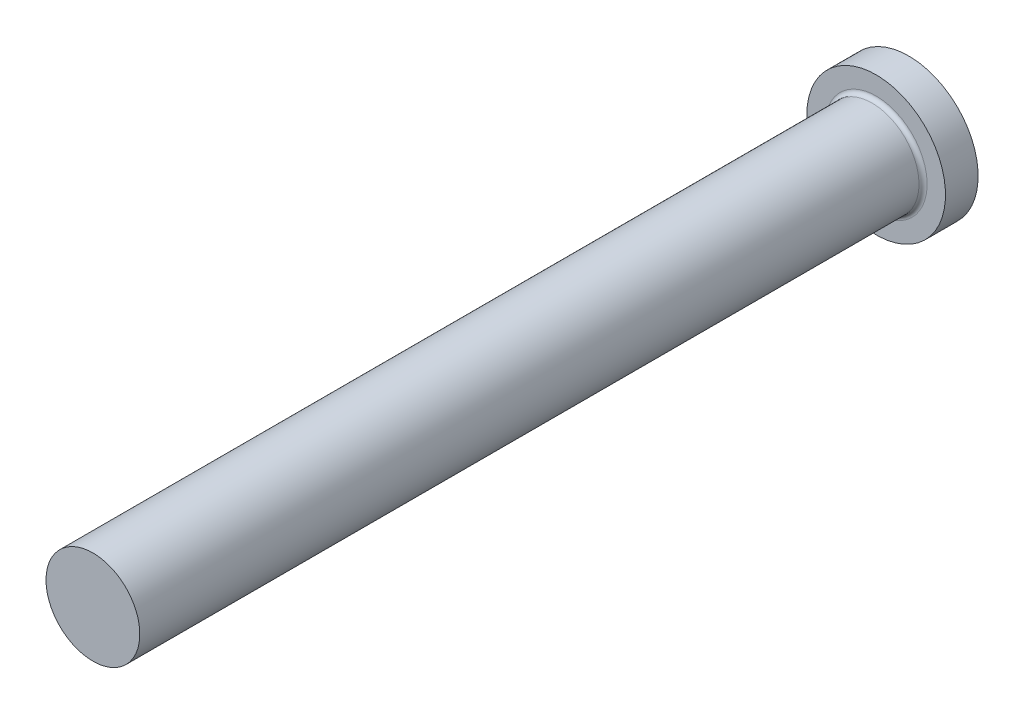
from build123d import *

# Parameters (mm, degrees)
FILLET1_R = 0.5


with BuildPart() as part:
    # FV → Revolve1 (revolve)
    with BuildSketch(Plane(origin=(0, 0, 0), x_dir=(1, 0, 0), z_dir=(0, 1, 0)), mode=Mode.PRIVATE) as revolve1_sk:
        Polygon((0, 0), (8.5, 0), (8.5, -4), (5.75, -4), (5.75, -100), (0, -100), align=None)
    revolve(revolve1_sk.sketch.rotate(Axis((0, 0, -9.033228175), (0, 0, 1)), 180), axis=Axis((0, 0, -9.033228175), (0, 0, 1)))

    # Fillet1
    fillet1_edges = [part.edges().sort_by_distance(p)[0] for p in [
        (5.75, 0, 4),
    ]]
    fillet(fillet1_edges, radius=FILLET1_R)


solid = part.part
